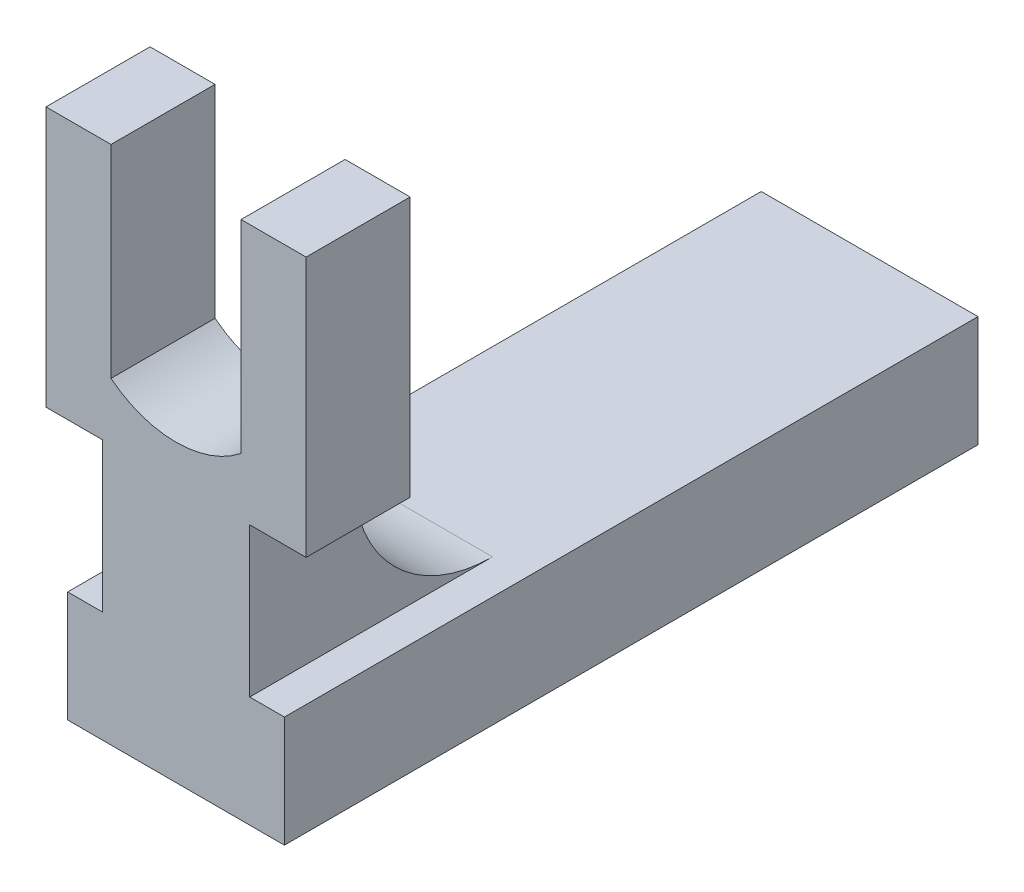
ISO-10303-21;
HEADER;
FILE_DESCRIPTION(('STEP AP214'),'2;1');
FILE_NAME('part.step','',(''),(''),'','','');
FILE_SCHEMA(('AUTOMOTIVE_DESIGN { 1 0 10303 214 1 1 1 1 }'));
ENDSEC;
DATA;
#1=APPLICATION_CONTEXT('core data for automotive mechanical design processes');
#2=APPLICATION_PROTOCOL_DEFINITION('international standard','automotive_design',2000,#1);
#3=PRODUCT_CONTEXT('',#1,'mechanical');
#4=PRODUCT('Part','Part','',(#3));
#5=PRODUCT_RELATED_PRODUCT_CATEGORY('part','',(#4));
#6=PRODUCT_DEFINITION_FORMATION('','',#4);
#7=PRODUCT_DEFINITION_CONTEXT('part definition',#1,'design');
#8=PRODUCT_DEFINITION('design','',#6,#7);
#9=PRODUCT_DEFINITION_SHAPE('','',#8);
#10=(LENGTH_UNIT() NAMED_UNIT(*) SI_UNIT(.MILLI.,.METRE.));
#11=(NAMED_UNIT(*) PLANE_ANGLE_UNIT() SI_UNIT($,.RADIAN.));
#12=(NAMED_UNIT(*) SI_UNIT($,.STERADIAN.) SOLID_ANGLE_UNIT());
#13=UNCERTAINTY_MEASURE_WITH_UNIT(LENGTH_MEASURE(1.E-05),#10,'distance_accuracy_value','');
#14=(GEOMETRIC_REPRESENTATION_CONTEXT(3) GLOBAL_UNCERTAINTY_ASSIGNED_CONTEXT((#13)) GLOBAL_UNIT_ASSIGNED_CONTEXT((#10,
#11,#12)) REPRESENTATION_CONTEXT('',''));
#15=CARTESIAN_POINT('',(0.,0.,0.));
#16=DIRECTION('',(0.,0.,1.));
#17=DIRECTION('',(1.,0.,0.));
#18=AXIS2_PLACEMENT_3D('',#15,#16,#17);
#19=CARTESIAN_POINT('',(11.75,6.39999999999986,40.));
#20=DIRECTION('',(-1.,-1.05697104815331E-13,0.));
#21=DIRECTION('',(1.05697104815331E-13,-1.,0.));
#22=AXIS2_PLACEMENT_3D('',#19,#20,#21);
#23=PLANE('',#22);
#24=DIRECTION('',(1.05697104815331E-13,-1.,0.));
#25=VECTOR('',#24,1.);
#26=CARTESIAN_POINT('',(11.75,6.39999999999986,34.));
#27=LINE('',#26,#25);
#28=CARTESIAN_POINT('',(11.7499999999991,14.9999999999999,34.));
#29=VERTEX_POINT('',#28);
#30=CARTESIAN_POINT('',(11.75,14.4000000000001,34.));
#31=VERTEX_POINT('',#30);
#32=EDGE_CURVE('E152',#29,#31,#27,.T.);
#33=ORIENTED_EDGE('',*,*,#32,.F.);
#34=DIRECTION('',(0.,0.,-1.));
#35=VECTOR('',#34,1.);
#36=CARTESIAN_POINT('',(11.7499999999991,14.9999999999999,40.));
#37=LINE('',#36,#35);
#38=CARTESIAN_POINT('',(11.7499999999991,14.9999999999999,40.));
#39=VERTEX_POINT('',#38);
#40=EDGE_CURVE('E186',#39,#29,#37,.T.);
#41=ORIENTED_EDGE('',*,*,#40,.F.);
#42=DIRECTION('',(-1.05697104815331E-13,1.,0.));
#43=VECTOR('',#42,1.);
#44=CARTESIAN_POINT('',(11.75,6.39999999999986,40.));
#45=LINE('',#44,#43);
#46=CARTESIAN_POINT('',(11.75,6.39999999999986,40.));
#47=VERTEX_POINT('',#46);
#48=EDGE_CURVE('E205',#47,#39,#45,.T.);
#49=ORIENTED_EDGE('',*,*,#48,.F.);
#50=DIRECTION('',(0.,0.,-1.));
#51=VECTOR('',#50,1.);
#52=CARTESIAN_POINT('',(11.75,6.39999999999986,40.));
#53=LINE('',#52,#51);
#54=CARTESIAN_POINT('',(11.75,6.40000000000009,26.));
#55=VERTEX_POINT('',#54);
#56=EDGE_CURVE('E189',#47,#55,#53,.T.);
#57=ORIENTED_EDGE('',*,*,#56,.T.);
#58=CARTESIAN_POINT('',(11.7499999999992,14.4000000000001,26.));
#59=DIRECTION('',(-1.,-1.05697104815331E-13,0.));
#60=DIRECTION('',(1.05697104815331E-13,-1.,0.));
#61=AXIS2_PLACEMENT_3D('',#58,#59,#60);
#62=CIRCLE('',#61,8.);
#63=EDGE_CURVE('E280',#31,#55,#62,.F.);
#64=ORIENTED_EDGE('',*,*,#63,.F.);
#65=EDGE_LOOP('',(#33,#41,#49,#57,#64));
#66=FACE_BOUND('',#65,.T.);
#67=ADVANCED_FACE('F33',(#66),#23,.F.);
#68=CARTESIAN_POINT('',(11.7499999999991,14.9999999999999,40.));
#69=DIRECTION('',(0.,1.,0.));
#70=DIRECTION('',(0.,0.,1.));
#71=AXIS2_PLACEMENT_3D('',#68,#69,#70);
#72=PLANE('',#71);
#73=DIRECTION('',(-1.,0.,0.));
#74=VECTOR('',#73,1.);
#75=CARTESIAN_POINT('',(11.7499999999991,14.9999999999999,34.));
#76=LINE('',#75,#74);
#77=CARTESIAN_POINT('',(14.9999999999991,14.9999999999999,34.));
#78=VERTEX_POINT('',#77);
#79=EDGE_CURVE('E263',#78,#29,#76,.T.);
#80=ORIENTED_EDGE('',*,*,#79,.F.);
#81=DIRECTION('',(0.,0.,-1.));
#82=VECTOR('',#81,1.);
#83=CARTESIAN_POINT('',(14.9999999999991,14.9999999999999,40.));
#84=LINE('',#83,#82);
#85=CARTESIAN_POINT('',(14.9999999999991,14.9999999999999,40.));
#86=VERTEX_POINT('',#85);
#87=EDGE_CURVE('E183',#86,#78,#84,.T.);
#88=ORIENTED_EDGE('',*,*,#87,.F.);
#89=DIRECTION('',(1.,0.,0.));
#90=VECTOR('',#89,1.);
#91=CARTESIAN_POINT('',(11.7499999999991,14.9999999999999,40.));
#92=LINE('',#91,#90);
#93=EDGE_CURVE('E207',#39,#86,#92,.T.);
#94=ORIENTED_EDGE('',*,*,#93,.F.);
#95=ORIENTED_EDGE('',*,*,#40,.T.);
#96=EDGE_LOOP('',(#80,#88,#94,#95));
#97=FACE_BOUND('',#96,.T.);
#98=ADVANCED_FACE('F282',(#97),#72,.F.);
#99=CARTESIAN_POINT('',(14.9999999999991,14.9999999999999,40.));
#100=DIRECTION('',(-1.,0.,0.));
#101=DIRECTION('',(0.,0.,1.));
#102=AXIS2_PLACEMENT_3D('',#99,#100,#101);
#103=PLANE('',#102);
#104=DIRECTION('',(0.,1.,0.));
#105=VECTOR('',#104,1.);
#106=CARTESIAN_POINT('',(14.9999999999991,14.4000000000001,34.));
#107=LINE('',#106,#105);
#108=CARTESIAN_POINT('',(14.9999999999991,30.0000000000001,34.));
#109=VERTEX_POINT('',#108);
#110=EDGE_CURVE('E270',#78,#109,#107,.T.);
#111=ORIENTED_EDGE('',*,*,#110,.T.);
#112=DIRECTION('',(0.,0.,-1.));
#113=VECTOR('',#112,1.);
#114=CARTESIAN_POINT('',(14.9999999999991,29.9999999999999,40.));
#115=LINE('',#114,#113);
#116=CARTESIAN_POINT('',(14.9999999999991,29.9999999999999,40.));
#117=VERTEX_POINT('',#116);
#118=EDGE_CURVE('E180',#117,#109,#115,.T.);
#119=ORIENTED_EDGE('',*,*,#118,.F.);
#120=DIRECTION('',(0.,1.,0.));
#121=VECTOR('',#120,1.);
#122=CARTESIAN_POINT('',(14.9999999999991,14.9999999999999,40.));
#123=LINE('',#122,#121);
#124=EDGE_CURVE('E213',#86,#117,#123,.T.);
#125=ORIENTED_EDGE('',*,*,#124,.F.);
#126=ORIENTED_EDGE('',*,*,#87,.T.);
#127=EDGE_LOOP('',(#111,#119,#125,#126));
#128=FACE_BOUND('',#127,.T.);
#129=ADVANCED_FACE('F351',(#128),#103,.F.);
#130=CARTESIAN_POINT('',(11.2499999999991,29.9999999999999,40.));
#131=DIRECTION('',(0.,-1.,0.));
#132=DIRECTION('',(0.,0.,-1.));
#133=AXIS2_PLACEMENT_3D('',#130,#131,#132);
#134=PLANE('',#133);
#135=DIRECTION('',(1.,0.,0.));
#136=VECTOR('',#135,1.);
#137=CARTESIAN_POINT('',(-25.0000000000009,30.0000000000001,34.));
#138=LINE('',#137,#136);
#139=CARTESIAN_POINT('',(11.2499999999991,30.0000000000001,34.));
#140=VERTEX_POINT('',#139);
#141=EDGE_CURVE('E305',#140,#109,#138,.T.);
#142=ORIENTED_EDGE('',*,*,#141,.F.);
#143=DIRECTION('',(0.,0.,-1.));
#144=VECTOR('',#143,1.);
#145=CARTESIAN_POINT('',(11.2499999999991,29.9999999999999,40.));
#146=LINE('',#145,#144);
#147=CARTESIAN_POINT('',(11.2499999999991,29.9999999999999,40.));
#148=VERTEX_POINT('',#147);
#149=EDGE_CURVE('E177',#148,#140,#146,.T.);
#150=ORIENTED_EDGE('',*,*,#149,.F.);
#151=DIRECTION('',(-1.,0.,0.));
#152=VECTOR('',#151,1.);
#153=CARTESIAN_POINT('',(11.2499999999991,29.9999999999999,40.));
#154=LINE('',#153,#152);
#155=EDGE_CURVE('E215',#117,#148,#154,.T.);
#156=ORIENTED_EDGE('',*,*,#155,.F.);
#157=ORIENTED_EDGE('',*,*,#118,.T.);
#158=EDGE_LOOP('',(#142,#150,#156,#157));
#159=FACE_BOUND('',#158,.T.);
#160=ADVANCED_FACE('F322',(#159),#134,.F.);
#161=CARTESIAN_POINT('',(11.2499999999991,18.3162515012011,40.));
#162=DIRECTION('',(1.,0.,0.));
#163=DIRECTION('',(0.,0.,-1.));
#164=AXIS2_PLACEMENT_3D('',#161,#162,#163);
#165=PLANE('',#164);
#166=DIRECTION('',(0.,1.,0.));
#167=VECTOR('',#166,1.);
#168=CARTESIAN_POINT('',(11.2499999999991,18.3162515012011,34.));
#169=LINE('',#168,#167);
#170=CARTESIAN_POINT('',(11.2499999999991,18.3162515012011,34.));
#171=VERTEX_POINT('',#170);
#172=EDGE_CURVE('E273',#171,#140,#169,.T.);
#173=ORIENTED_EDGE('',*,*,#172,.F.);
#174=DIRECTION('',(0.,0.,-1.));
#175=VECTOR('',#174,1.);
#176=CARTESIAN_POINT('',(11.2499999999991,18.3162515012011,40.));
#177=LINE('',#176,#175);
#178=CARTESIAN_POINT('',(11.2499999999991,18.3162515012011,40.));
#179=VERTEX_POINT('',#178);
#180=EDGE_CURVE('E174',#179,#171,#177,.T.);
#181=ORIENTED_EDGE('',*,*,#180,.F.);
#182=DIRECTION('',(0.,-1.,0.));
#183=VECTOR('',#182,1.);
#184=CARTESIAN_POINT('',(11.2499999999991,18.3162515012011,40.));
#185=LINE('',#184,#183);
#186=EDGE_CURVE('E217',#148,#179,#185,.T.);
#187=ORIENTED_EDGE('',*,*,#186,.F.);
#188=ORIENTED_EDGE('',*,*,#149,.T.);
#189=EDGE_LOOP('',(#173,#181,#187,#188));
#190=FACE_BOUND('',#189,.T.);
#191=ADVANCED_FACE('F325',(#190),#165,.F.);
#192=CARTESIAN_POINT('',(7.49999999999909,22.9999999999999,40.));
#193=DIRECTION('',(0.,0.,-1.));
#194=DIRECTION('',(-1.,0.,0.));
#195=AXIS2_PLACEMENT_3D('',#192,#193,#194);
#196=CYLINDRICAL_SURFACE('',#195,5.99999999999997);
#197=CARTESIAN_POINT('',(7.49999999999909,22.9999999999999,34.));
#198=DIRECTION('',(0.,0.,-1.));
#199=DIRECTION('',(-1.,0.,0.));
#200=AXIS2_PLACEMENT_3D('',#197,#198,#199);
#201=CIRCLE('',#200,5.99999999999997);
#202=CARTESIAN_POINT('',(3.74999999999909,18.3162515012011,34.));
#203=VERTEX_POINT('',#202);
#204=EDGE_CURVE('E258',#203,#171,#201,.F.);
#205=ORIENTED_EDGE('',*,*,#204,.F.);
#206=DIRECTION('',(0.,0.,-1.));
#207=VECTOR('',#206,1.);
#208=CARTESIAN_POINT('',(3.74999999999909,18.3162515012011,40.));
#209=LINE('',#208,#207);
#210=CARTESIAN_POINT('',(3.74999999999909,18.3162515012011,40.));
#211=VERTEX_POINT('',#210);
#212=EDGE_CURVE('E171',#211,#203,#209,.T.);
#213=ORIENTED_EDGE('',*,*,#212,.F.);
#214=CARTESIAN_POINT('',(7.49999999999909,22.9999999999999,40.));
#215=DIRECTION('',(0.,0.,-1.));
#216=DIRECTION('',(1.,0.,0.));
#217=AXIS2_PLACEMENT_3D('',#214,#215,#216);
#218=CIRCLE('',#217,5.99999999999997);
#219=EDGE_CURVE('E219',#179,#211,#218,.T.);
#220=ORIENTED_EDGE('',*,*,#219,.F.);
#221=ORIENTED_EDGE('',*,*,#180,.T.);
#222=EDGE_LOOP('',(#205,#213,#220,#221));
#223=FACE_BOUND('',#222,.T.);
#224=ADVANCED_FACE('F331',(#223),#196,.F.);
#225=CARTESIAN_POINT('',(3.74999999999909,18.3162515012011,40.));
#226=DIRECTION('',(-1.,0.,0.));
#227=DIRECTION('',(0.,-1.,0.));
#228=AXIS2_PLACEMENT_3D('',#225,#226,#227);
#229=PLANE('',#228);
#230=DIRECTION('',(0.,-1.,0.));
#231=VECTOR('',#230,1.);
#232=CARTESIAN_POINT('',(3.74999999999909,18.3162515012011,34.));
#233=LINE('',#232,#231);
#234=CARTESIAN_POINT('',(3.75,30.0000000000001,34.));
#235=VERTEX_POINT('',#234);
#236=EDGE_CURVE('E314',#235,#203,#233,.T.);
#237=ORIENTED_EDGE('',*,*,#236,.F.);
#238=DIRECTION('',(0.,0.,-1.));
#239=VECTOR('',#238,1.);
#240=CARTESIAN_POINT('',(3.75,29.9999999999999,40.));
#241=LINE('',#240,#239);
#242=CARTESIAN_POINT('',(3.75,29.9999999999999,40.));
#243=VERTEX_POINT('',#242);
#244=EDGE_CURVE('E168',#243,#235,#241,.T.);
#245=ORIENTED_EDGE('',*,*,#244,.F.);
#246=DIRECTION('',(0.,1.,0.));
#247=VECTOR('',#246,1.);
#248=CARTESIAN_POINT('',(3.74999999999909,18.3162515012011,40.));
#249=LINE('',#248,#247);
#250=EDGE_CURVE('E221',#211,#243,#249,.T.);
#251=ORIENTED_EDGE('',*,*,#250,.F.);
#252=ORIENTED_EDGE('',*,*,#212,.T.);
#253=EDGE_LOOP('',(#237,#245,#251,#252));
#254=FACE_BOUND('',#253,.T.);
#255=ADVANCED_FACE('F334',(#254),#229,.F.);
#256=CARTESIAN_POINT('',(-9.09494701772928E-13,29.9999999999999,40.));
#257=DIRECTION('',(0.,-1.,0.));
#258=DIRECTION('',(0.,0.,-1.));
#259=AXIS2_PLACEMENT_3D('',#256,#257,#258);
#260=PLANE('',#259);
#261=CARTESIAN_POINT('',(-9.08995101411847E-13,30.0000000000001,34.));
#262=VERTEX_POINT('',#261);
#263=EDGE_CURVE('E303',#262,#235,#138,.T.);
#264=ORIENTED_EDGE('',*,*,#263,.F.);
#265=DIRECTION('',(0.,0.,-1.));
#266=VECTOR('',#265,1.);
#267=CARTESIAN_POINT('',(-9.09494701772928E-13,29.9999999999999,40.));
#268=LINE('',#267,#266);
#269=CARTESIAN_POINT('',(-9.09494701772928E-13,29.9999999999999,40.));
#270=VERTEX_POINT('',#269);
#271=EDGE_CURVE('E165',#270,#262,#268,.T.);
#272=ORIENTED_EDGE('',*,*,#271,.F.);
#273=DIRECTION('',(-1.,0.,0.));
#274=VECTOR('',#273,1.);
#275=CARTESIAN_POINT('',(-9.09494701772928E-13,29.9999999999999,40.));
#276=LINE('',#275,#274);
#277=EDGE_CURVE('E223',#243,#270,#276,.T.);
#278=ORIENTED_EDGE('',*,*,#277,.F.);
#279=ORIENTED_EDGE('',*,*,#244,.T.);
#280=EDGE_LOOP('',(#264,#272,#278,#279));
#281=FACE_BOUND('',#280,.T.);
#282=ADVANCED_FACE('F337',(#281),#260,.F.);
#283=CARTESIAN_POINT('',(-9.09494701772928E-13,14.9999999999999,40.));
#284=DIRECTION('',(1.,0.,0.));
#285=DIRECTION('',(0.,0.,-1.));
#286=AXIS2_PLACEMENT_3D('',#283,#284,#285);
#287=PLANE('',#286);
#288=DIRECTION('',(0.,1.,0.));
#289=VECTOR('',#288,1.);
#290=CARTESIAN_POINT('',(-9.09494701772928E-13,14.9999999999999,34.));
#291=LINE('',#290,#289);
#292=CARTESIAN_POINT('',(-9.09494701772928E-13,14.9999999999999,34.));
#293=VERTEX_POINT('',#292);
#294=EDGE_CURVE('E235',#293,#262,#291,.T.);
#295=ORIENTED_EDGE('',*,*,#294,.F.);
#296=DIRECTION('',(0.,0.,-1.));
#297=VECTOR('',#296,1.);
#298=CARTESIAN_POINT('',(-9.09494701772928E-13,14.9999999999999,40.));
#299=LINE('',#298,#297);
#300=CARTESIAN_POINT('',(-9.09494701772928E-13,14.9999999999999,40.));
#301=VERTEX_POINT('',#300);
#302=EDGE_CURVE('E162',#301,#293,#299,.T.);
#303=ORIENTED_EDGE('',*,*,#302,.F.);
#304=DIRECTION('',(0.,-1.,0.));
#305=VECTOR('',#304,1.);
#306=CARTESIAN_POINT('',(-9.09494701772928E-13,14.9999999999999,40.));
#307=LINE('',#306,#305);
#308=EDGE_CURVE('E225',#270,#301,#307,.T.);
#309=ORIENTED_EDGE('',*,*,#308,.F.);
#310=ORIENTED_EDGE('',*,*,#271,.T.);
#311=EDGE_LOOP('',(#295,#303,#309,#310));
#312=FACE_BOUND('',#311,.T.);
#313=ADVANCED_FACE('F232',(#312),#287,.F.);
#314=CARTESIAN_POINT('',(-9.09494701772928E-13,14.9999999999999,40.));
#315=DIRECTION('',(0.,1.,0.));
#316=DIRECTION('',(0.,0.,1.));
#317=AXIS2_PLACEMENT_3D('',#314,#315,#316);
#318=PLANE('',#317);
#319=DIRECTION('',(-1.,0.,0.));
#320=VECTOR('',#319,1.);
#321=CARTESIAN_POINT('',(-9.09494701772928E-13,14.9999999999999,34.));
#322=LINE('',#321,#320);
#323=CARTESIAN_POINT('',(3.24999999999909,14.9999999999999,34.));
#324=VERTEX_POINT('',#323);
#325=EDGE_CURVE('E241',#324,#293,#322,.T.);
#326=ORIENTED_EDGE('',*,*,#325,.F.);
#327=DIRECTION('',(0.,0.,-1.));
#328=VECTOR('',#327,1.);
#329=CARTESIAN_POINT('',(3.24999999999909,14.9999999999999,40.));
#330=LINE('',#329,#328);
#331=CARTESIAN_POINT('',(3.24999999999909,14.9999999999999,40.));
#332=VERTEX_POINT('',#331);
#333=EDGE_CURVE('E140',#332,#324,#330,.T.);
#334=ORIENTED_EDGE('',*,*,#333,.F.);
#335=DIRECTION('',(1.,0.,0.));
#336=VECTOR('',#335,1.);
#337=CARTESIAN_POINT('',(-9.09494701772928E-13,14.9999999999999,40.));
#338=LINE('',#337,#336);
#339=EDGE_CURVE('E125',#301,#332,#338,.T.);
#340=ORIENTED_EDGE('',*,*,#339,.F.);
#341=ORIENTED_EDGE('',*,*,#302,.T.);
#342=EDGE_LOOP('',(#326,#334,#340,#341));
#343=FACE_BOUND('',#342,.T.);
#344=ADVANCED_FACE('F238',(#343),#318,.F.);
#345=CARTESIAN_POINT('',(3.24999999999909,6.39999999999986,40.));
#346=DIRECTION('',(1.,0.,0.));
#347=DIRECTION('',(0.,0.,-1.));
#348=AXIS2_PLACEMENT_3D('',#345,#346,#347);
#349=PLANE('',#348);
#350=DIRECTION('',(0.,1.,0.));
#351=VECTOR('',#350,1.);
#352=CARTESIAN_POINT('',(3.24999999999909,6.39999999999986,34.));
#353=LINE('',#352,#351);
#354=CARTESIAN_POINT('',(3.24999999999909,14.4000000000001,34.));
#355=VERTEX_POINT('',#354);
#356=EDGE_CURVE('E12',#355,#324,#353,.T.);
#357=ORIENTED_EDGE('',*,*,#356,.F.);
#358=CARTESIAN_POINT('',(3.24999999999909,14.4000000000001,26.));
#359=DIRECTION('',(1.,0.,0.));
#360=DIRECTION('',(0.,0.,-1.));
#361=AXIS2_PLACEMENT_3D('',#358,#359,#360);
#362=CIRCLE('',#361,8.);
#363=CARTESIAN_POINT('',(3.24999999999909,6.40000000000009,26.));
#364=VERTEX_POINT('',#363);
#365=EDGE_CURVE('E137',#364,#355,#362,.F.);
#366=ORIENTED_EDGE('',*,*,#365,.F.);
#367=DIRECTION('',(0.,0.,-1.));
#368=VECTOR('',#367,1.);
#369=CARTESIAN_POINT('',(3.24999999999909,6.39999999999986,40.));
#370=LINE('',#369,#368);
#371=CARTESIAN_POINT('',(3.24999999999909,6.39999999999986,40.));
#372=VERTEX_POINT('',#371);
#373=EDGE_CURVE('E132',#372,#364,#370,.T.);
#374=ORIENTED_EDGE('',*,*,#373,.F.);
#375=DIRECTION('',(0.,-1.,0.));
#376=VECTOR('',#375,1.);
#377=CARTESIAN_POINT('',(3.24999999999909,6.39999999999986,40.));
#378=LINE('',#377,#376);
#379=EDGE_CURVE('E119',#332,#372,#378,.T.);
#380=ORIENTED_EDGE('',*,*,#379,.F.);
#381=ORIENTED_EDGE('',*,*,#333,.T.);
#382=EDGE_LOOP('',(#357,#366,#374,#380,#381));
#383=FACE_BOUND('',#382,.T.);
#384=ADVANCED_FACE('F134',(#383),#349,.F.);
#385=CARTESIAN_POINT('',(7.49999999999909,22.9999999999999,0.));
#386=DIRECTION('',(0.,0.,1.));
#387=DIRECTION('',(1.,0.,0.));
#388=AXIS2_PLACEMENT_3D('',#385,#386,#387);
#389=PLANE('',#388);
#390=DIRECTION('',(-1.,0.,0.));
#391=VECTOR('',#390,1.);
#392=CARTESIAN_POINT('',(1.24999999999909,6.39999999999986,0.));
#393=LINE('',#392,#391);
#394=CARTESIAN_POINT('',(13.7499999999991,6.39999999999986,0.));
#395=VERTEX_POINT('',#394);
#396=CARTESIAN_POINT('',(1.24999999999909,6.39999999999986,0.));
#397=VERTEX_POINT('',#396);
#398=EDGE_CURVE('E155',#395,#397,#393,.T.);
#399=ORIENTED_EDGE('',*,*,#398,.F.);
#400=DIRECTION('',(0.,1.,0.));
#401=VECTOR('',#400,1.);
#402=CARTESIAN_POINT('',(13.7499999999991,-1.13686837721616E-13,0.));
#403=LINE('',#402,#401);
#404=CARTESIAN_POINT('',(13.7499999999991,-1.13686837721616E-13,0.));
#405=VERTEX_POINT('',#404);
#406=EDGE_CURVE('E151',#405,#395,#403,.T.);
#407=ORIENTED_EDGE('',*,*,#406,.F.);
#408=DIRECTION('',(1.,0.,0.));
#409=VECTOR('',#408,1.);
#410=CARTESIAN_POINT('',(1.24999999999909,-1.13686837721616E-13,0.));
#411=LINE('',#410,#409);
#412=CARTESIAN_POINT('',(1.24999999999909,-1.13686837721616E-13,0.));
#413=VERTEX_POINT('',#412);
#414=EDGE_CURVE('E148',#413,#405,#411,.T.);
#415=ORIENTED_EDGE('',*,*,#414,.F.);
#416=DIRECTION('',(0.,-1.,0.));
#417=VECTOR('',#416,1.);
#418=CARTESIAN_POINT('',(1.24999999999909,-1.13686837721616E-13,0.));
#419=LINE('',#418,#417);
#420=EDGE_CURVE('E71',#397,#413,#419,.T.);
#421=ORIENTED_EDGE('',*,*,#420,.F.);
#422=EDGE_LOOP('',(#399,#407,#415,#421));
#423=FACE_BOUND('',#422,.T.);
#424=ADVANCED_FACE('F200',(#423),#389,.F.);
#425=CARTESIAN_POINT('',(1.24999999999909,-1.13686837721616E-13,40.));
#426=DIRECTION('',(0.,1.,0.));
#427=DIRECTION('',(0.,0.,1.));
#428=AXIS2_PLACEMENT_3D('',#425,#426,#427);
#429=PLANE('',#428);
#430=ORIENTED_EDGE('',*,*,#414,.T.);
#431=DIRECTION('',(0.,0.,-1.));
#432=VECTOR('',#431,1.);
#433=CARTESIAN_POINT('',(13.7499999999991,-1.13686837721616E-13,40.));
#434=LINE('',#433,#432);
#435=CARTESIAN_POINT('',(13.7499999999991,-1.13686837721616E-13,40.));
#436=VERTEX_POINT('',#435);
#437=EDGE_CURVE('E42',#436,#405,#434,.T.);
#438=ORIENTED_EDGE('',*,*,#437,.F.);
#439=DIRECTION('',(1.,0.,0.));
#440=VECTOR('',#439,1.);
#441=CARTESIAN_POINT('',(1.24999999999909,-1.13686837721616E-13,40.));
#442=LINE('',#441,#440);
#443=CARTESIAN_POINT('',(1.24999999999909,-1.13686837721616E-13,40.));
#444=VERTEX_POINT('',#443);
#445=EDGE_CURVE('E158',#444,#436,#442,.T.);
#446=ORIENTED_EDGE('',*,*,#445,.F.);
#447=DIRECTION('',(0.,0.,-1.));
#448=VECTOR('',#447,1.);
#449=CARTESIAN_POINT('',(1.24999999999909,-1.13686837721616E-13,40.));
#450=LINE('',#449,#448);
#451=EDGE_CURVE('E144',#444,#413,#450,.T.);
#452=ORIENTED_EDGE('',*,*,#451,.T.);
#453=EDGE_LOOP('',(#430,#438,#446,#452));
#454=FACE_BOUND('',#453,.T.);
#455=ADVANCED_FACE('F35',(#454),#429,.F.);
#456=CARTESIAN_POINT('',(13.7499999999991,-1.13686837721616E-13,40.));
#457=DIRECTION('',(-1.,0.,0.));
#458=DIRECTION('',(0.,0.,1.));
#459=AXIS2_PLACEMENT_3D('',#456,#457,#458);
#460=PLANE('',#459);
#461=ORIENTED_EDGE('',*,*,#406,.T.);
#462=DIRECTION('',(0.,0.,-1.));
#463=VECTOR('',#462,1.);
#464=CARTESIAN_POINT('',(13.7499999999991,6.39999999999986,40.));
#465=LINE('',#464,#463);
#466=CARTESIAN_POINT('',(13.7499999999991,6.39999999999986,40.));
#467=VERTEX_POINT('',#466);
#468=EDGE_CURVE('E192',#467,#395,#465,.T.);
#469=ORIENTED_EDGE('',*,*,#468,.F.);
#470=DIRECTION('',(0.,1.,0.));
#471=VECTOR('',#470,1.);
#472=CARTESIAN_POINT('',(13.7499999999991,-1.13686837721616E-13,40.));
#473=LINE('',#472,#471);
#474=EDGE_CURVE('E80',#436,#467,#473,.T.);
#475=ORIENTED_EDGE('',*,*,#474,.F.);
#476=ORIENTED_EDGE('',*,*,#437,.T.);
#477=EDGE_LOOP('',(#461,#469,#475,#476));
#478=FACE_BOUND('',#477,.T.);
#479=ADVANCED_FACE('F194',(#478),#460,.F.);
#480=CARTESIAN_POINT('',(1.24999999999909,6.39999999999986,40.));
#481=DIRECTION('',(0.,-1.,0.));
#482=DIRECTION('',(0.,0.,-1.));
#483=AXIS2_PLACEMENT_3D('',#480,#481,#482);
#484=PLANE('',#483);
#485=ORIENTED_EDGE('',*,*,#373,.T.);
#486=DIRECTION('',(1.,0.,0.));
#487=VECTOR('',#486,1.);
#488=CARTESIAN_POINT('',(-25.0000000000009,6.40000000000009,26.));
#489=LINE('',#488,#487);
#490=EDGE_CURVE('E302',#364,#55,#489,.T.);
#491=ORIENTED_EDGE('',*,*,#490,.T.);
#492=ORIENTED_EDGE('',*,*,#56,.F.);
#493=DIRECTION('',(-1.,0.,0.));
#494=VECTOR('',#493,1.);
#495=CARTESIAN_POINT('',(11.75,6.39999999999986,40.));
#496=LINE('',#495,#494);
#497=EDGE_CURVE('E203',#467,#47,#496,.T.);
#498=ORIENTED_EDGE('',*,*,#497,.F.);
#499=ORIENTED_EDGE('',*,*,#468,.T.);
#500=ORIENTED_EDGE('',*,*,#398,.T.);
#501=DIRECTION('',(0.,0.,-1.));
#502=VECTOR('',#501,1.);
#503=CARTESIAN_POINT('',(1.24999999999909,6.39999999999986,40.));
#504=LINE('',#503,#502);
#505=CARTESIAN_POINT('',(1.24999999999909,6.39999999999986,40.));
#506=VERTEX_POINT('',#505);
#507=EDGE_CURVE('E67',#506,#397,#504,.T.);
#508=ORIENTED_EDGE('',*,*,#507,.F.);
#509=DIRECTION('',(-1.,0.,0.));
#510=VECTOR('',#509,1.);
#511=CARTESIAN_POINT('',(1.24999999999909,6.39999999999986,40.));
#512=LINE('',#511,#510);
#513=EDGE_CURVE('E123',#372,#506,#512,.T.);
#514=ORIENTED_EDGE('',*,*,#513,.F.);
#515=EDGE_LOOP('',(#485,#491,#492,#498,#499,#500,#508,#514));
#516=FACE_BOUND('',#515,.T.);
#517=ADVANCED_FACE('F142',(#516),#484,.F.);
#518=CARTESIAN_POINT('',(1.24999999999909,-1.13686837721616E-13,40.));
#519=DIRECTION('',(1.,0.,0.));
#520=DIRECTION('',(0.,0.,-1.));
#521=AXIS2_PLACEMENT_3D('',#518,#519,#520);
#522=PLANE('',#521);
#523=ORIENTED_EDGE('',*,*,#420,.T.);
#524=ORIENTED_EDGE('',*,*,#451,.F.);
#525=DIRECTION('',(0.,-1.,0.));
#526=VECTOR('',#525,1.);
#527=CARTESIAN_POINT('',(1.24999999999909,-1.13686837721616E-13,40.));
#528=LINE('',#527,#526);
#529=EDGE_CURVE('E50',#506,#444,#528,.T.);
#530=ORIENTED_EDGE('',*,*,#529,.F.);
#531=ORIENTED_EDGE('',*,*,#507,.T.);
#532=EDGE_LOOP('',(#523,#524,#530,#531));
#533=FACE_BOUND('',#532,.T.);
#534=ADVANCED_FACE('F359',(#533),#522,.F.);
#535=CARTESIAN_POINT('',(7.49999999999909,22.9999999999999,40.));
#536=DIRECTION('',(0.,0.,1.));
#537=DIRECTION('',(1.,0.,0.));
#538=AXIS2_PLACEMENT_3D('',#535,#536,#537);
#539=PLANE('',#538);
#540=ORIENTED_EDGE('',*,*,#445,.T.);
#541=ORIENTED_EDGE('',*,*,#474,.T.);
#542=ORIENTED_EDGE('',*,*,#497,.T.);
#543=ORIENTED_EDGE('',*,*,#48,.T.);
#544=ORIENTED_EDGE('',*,*,#93,.T.);
#545=ORIENTED_EDGE('',*,*,#124,.T.);
#546=ORIENTED_EDGE('',*,*,#155,.T.);
#547=ORIENTED_EDGE('',*,*,#186,.T.);
#548=ORIENTED_EDGE('',*,*,#219,.T.);
#549=ORIENTED_EDGE('',*,*,#250,.T.);
#550=ORIENTED_EDGE('',*,*,#277,.T.);
#551=ORIENTED_EDGE('',*,*,#308,.T.);
#552=ORIENTED_EDGE('',*,*,#339,.T.);
#553=ORIENTED_EDGE('',*,*,#379,.T.);
#554=ORIENTED_EDGE('',*,*,#513,.T.);
#555=ORIENTED_EDGE('',*,*,#529,.T.);
#556=EDGE_LOOP('',(#540,#541,#542,#543,#544,#545,#546,#547,#548,#549,#550,#551,#552,#553,#554,#555));
#557=FACE_BOUND('',#556,.T.);
#558=ADVANCED_FACE('F121',(#557),#539,.T.);
#559=CARTESIAN_POINT('',(-25.0000000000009,14.4000000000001,34.));
#560=DIRECTION('',(0.,0.,-1.));
#561=DIRECTION('',(-1.,0.,0.));
#562=AXIS2_PLACEMENT_3D('',#559,#560,#561);
#563=PLANE('',#562);
#564=ORIENTED_EDGE('',*,*,#32,.T.);
#565=DIRECTION('',(1.,0.,0.));
#566=VECTOR('',#565,1.);
#567=CARTESIAN_POINT('',(-25.0000000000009,14.4000000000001,34.));
#568=LINE('',#567,#566);
#569=EDGE_CURVE('E301',#355,#31,#568,.T.);
#570=ORIENTED_EDGE('',*,*,#569,.F.);
#571=ORIENTED_EDGE('',*,*,#356,.T.);
#572=ORIENTED_EDGE('',*,*,#325,.T.);
#573=ORIENTED_EDGE('',*,*,#294,.T.);
#574=ORIENTED_EDGE('',*,*,#263,.T.);
#575=ORIENTED_EDGE('',*,*,#236,.T.);
#576=ORIENTED_EDGE('',*,*,#204,.T.);
#577=ORIENTED_EDGE('',*,*,#172,.T.);
#578=ORIENTED_EDGE('',*,*,#141,.T.);
#579=ORIENTED_EDGE('',*,*,#110,.F.);
#580=ORIENTED_EDGE('',*,*,#79,.T.);
#581=EDGE_LOOP('',(#564,#570,#571,#572,#573,#574,#575,#576,#577,#578,#579,#580));
#582=FACE_BOUND('',#581,.T.);
#583=ADVANCED_FACE('F265',(#582),#563,.T.);
#584=CARTESIAN_POINT('',(-25.0000000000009,14.4000000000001,26.));
#585=DIRECTION('',(1.,0.,0.));
#586=DIRECTION('',(0.,0.,-1.));
#587=AXIS2_PLACEMENT_3D('',#584,#585,#586);
#588=CYLINDRICAL_SURFACE('',#587,8.);
#589=ORIENTED_EDGE('',*,*,#63,.T.);
#590=ORIENTED_EDGE('',*,*,#490,.F.);
#591=ORIENTED_EDGE('',*,*,#365,.T.);
#592=ORIENTED_EDGE('',*,*,#569,.T.);
#593=EDGE_LOOP('',(#589,#590,#591,#592));
#594=FACE_BOUND('',#593,.T.);
#595=ADVANCED_FACE('F300',(#594),#588,.F.);
#596=CLOSED_SHELL('',(#67,#98,#129,#160,#191,#224,#255,#282,#313,#344,#384,#424,#455,#479,#517,
#534,#558,#583,#595));
#597=MANIFOLD_SOLID_BREP('B2',#596);
#598=ADVANCED_BREP_SHAPE_REPRESENTATION('',(#18,#597),#14);
#599=SHAPE_DEFINITION_REPRESENTATION(#9,#598);
ENDSEC;
END-ISO-10303-21;
